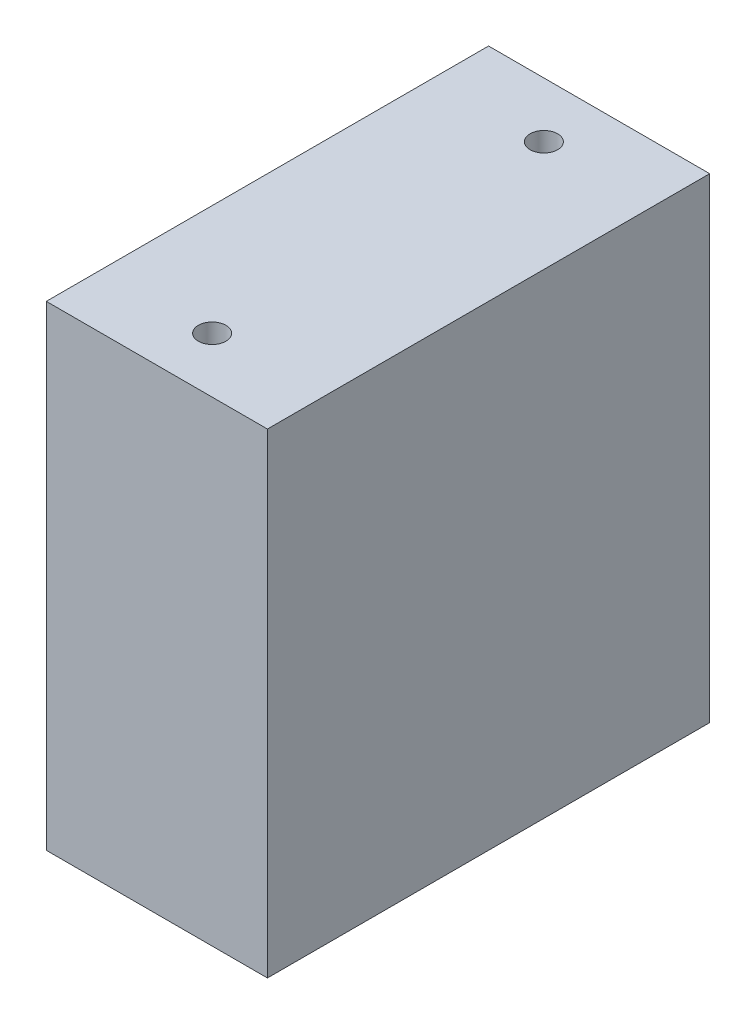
ISO-10303-21;
HEADER;
FILE_DESCRIPTION(('STEP AP214'),'2;1');
FILE_NAME('part.step','',(''),(''),'','','');
FILE_SCHEMA(('AUTOMOTIVE_DESIGN { 1 0 10303 214 1 1 1 1 }'));
ENDSEC;
DATA;
#1=APPLICATION_CONTEXT('core data for automotive mechanical design processes');
#2=APPLICATION_PROTOCOL_DEFINITION('international standard','automotive_design',2000,#1);
#3=PRODUCT_CONTEXT('',#1,'mechanical');
#4=PRODUCT('Part','Part','',(#3));
#5=PRODUCT_RELATED_PRODUCT_CATEGORY('part','',(#4));
#6=PRODUCT_DEFINITION_FORMATION('','',#4);
#7=PRODUCT_DEFINITION_CONTEXT('part definition',#1,'design');
#8=PRODUCT_DEFINITION('design','',#6,#7);
#9=PRODUCT_DEFINITION_SHAPE('','',#8);
#10=(LENGTH_UNIT() NAMED_UNIT(*) SI_UNIT(.MILLI.,.METRE.));
#11=(NAMED_UNIT(*) PLANE_ANGLE_UNIT() SI_UNIT($,.RADIAN.));
#12=(NAMED_UNIT(*) SI_UNIT($,.STERADIAN.) SOLID_ANGLE_UNIT());
#13=UNCERTAINTY_MEASURE_WITH_UNIT(LENGTH_MEASURE(1.E-05),#10,'distance_accuracy_value','');
#14=(GEOMETRIC_REPRESENTATION_CONTEXT(3) GLOBAL_UNCERTAINTY_ASSIGNED_CONTEXT((#13)) GLOBAL_UNIT_ASSIGNED_CONTEXT((#10,
#11,#12)) REPRESENTATION_CONTEXT('',''));
#15=CARTESIAN_POINT('',(0.,0.,0.));
#16=DIRECTION('',(0.,0.,1.));
#17=DIRECTION('',(1.,0.,0.));
#18=AXIS2_PLACEMENT_3D('',#15,#16,#17);
#19=CARTESIAN_POINT('',(0.,65.9999999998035,30.));
#20=DIRECTION('',(0.,1.,0.));
#21=DIRECTION('',(0.,0.,1.));
#22=AXIS2_PLACEMENT_3D('',#19,#20,#21);
#23=CONICAL_SURFACE('',#22,2.49999999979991,1.02974425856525);
#24=CARTESIAN_POINT('',(0.,64.4978484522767,30.));
#25=VERTEX_POINT('',#24);
#26=VERTEX_LOOP('',#25);
#27=FACE_BOUND('',#26,.T.);
#28=CARTESIAN_POINT('',(0.,66.,30.));
#29=DIRECTION('',(0.,1.,0.));
#30=DIRECTION('',(0.,0.,1.));
#31=AXIS2_PLACEMENT_3D('',#28,#29,#30);
#32=CIRCLE('',#31,2.5);
#33=CARTESIAN_POINT('',(0.,66.,32.5));
#34=VERTEX_POINT('',#33);
#35=EDGE_CURVE('E72',#34,#34,#32,.T.);
#36=ORIENTED_EDGE('',*,*,#35,.T.);
#37=EDGE_LOOP('',(#36));
#38=FACE_BOUND('',#37,.T.);
#39=ADVANCED_FACE('F17',(#27,#38),#23,.F.);
#40=CARTESIAN_POINT('',(0.,65.9999999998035,-30.));
#41=DIRECTION('',(0.,1.,0.));
#42=DIRECTION('',(0.,0.,1.));
#43=AXIS2_PLACEMENT_3D('',#40,#41,#42);
#44=CONICAL_SURFACE('',#43,2.49999999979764,1.02974425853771);
#45=CARTESIAN_POINT('',(0.,64.4978484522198,-30.));
#46=VERTEX_POINT('',#45);
#47=VERTEX_LOOP('',#46);
#48=FACE_BOUND('',#47,.T.);
#49=CARTESIAN_POINT('',(0.,66.,-30.));
#50=DIRECTION('',(0.,1.,0.));
#51=DIRECTION('',(0.,0.,1.));
#52=AXIS2_PLACEMENT_3D('',#49,#50,#51);
#53=CIRCLE('',#52,2.5);
#54=CARTESIAN_POINT('',(0.,66.,-27.5));
#55=VERTEX_POINT('',#54);
#56=EDGE_CURVE('E74',#55,#55,#53,.T.);
#57=ORIENTED_EDGE('',*,*,#56,.T.);
#58=EDGE_LOOP('',(#57));
#59=FACE_BOUND('',#58,.T.);
#60=ADVANCED_FACE('F69',(#48,#59),#44,.F.);
#61=CARTESIAN_POINT('',(0.,20.0000000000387,30.));
#62=DIRECTION('',(0.,-1.,0.));
#63=DIRECTION('',(0.,0.,-1.));
#64=AXIS2_PLACEMENT_3D('',#61,#62,#63);
#65=CONICAL_SURFACE('',#64,2.50000000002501,1.0297442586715);
#66=CARTESIAN_POINT('',(0.,21.5021515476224,30.));
#67=VERTEX_POINT('',#66);
#68=VERTEX_LOOP('',#67);
#69=FACE_BOUND('',#68,.T.);
#70=CARTESIAN_POINT('',(0.,20.,30.));
#71=DIRECTION('',(0.,-1.,0.));
#72=DIRECTION('',(0.,0.,-1.));
#73=AXIS2_PLACEMENT_3D('',#70,#71,#72);
#74=CIRCLE('',#73,2.5);
#75=CARTESIAN_POINT('',(0.,20.,27.5));
#76=VERTEX_POINT('',#75);
#77=EDGE_CURVE('E77',#76,#76,#74,.T.);
#78=ORIENTED_EDGE('',*,*,#77,.T.);
#79=EDGE_LOOP('',(#78));
#80=FACE_BOUND('',#79,.T.);
#81=ADVANCED_FACE('F110',(#69,#80),#65,.F.);
#82=CARTESIAN_POINT('',(0.,20.0000000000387,-30.));
#83=DIRECTION('',(0.,-1.,0.));
#84=DIRECTION('',(0.,0.,-1.));
#85=AXIS2_PLACEMENT_3D('',#82,#83,#84);
#86=CONICAL_SURFACE('',#85,2.49999999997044,1.02974425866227);
#87=CARTESIAN_POINT('',(0.,21.5021515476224,-30.));
#88=VERTEX_POINT('',#87);
#89=VERTEX_LOOP('',#88);
#90=FACE_BOUND('',#89,.T.);
#91=CARTESIAN_POINT('',(0.,20.,-30.));
#92=DIRECTION('',(0.,-1.,0.));
#93=DIRECTION('',(0.,0.,-1.));
#94=AXIS2_PLACEMENT_3D('',#91,#92,#93);
#95=CIRCLE('',#94,2.5);
#96=CARTESIAN_POINT('',(0.,20.,-32.5));
#97=VERTEX_POINT('',#96);
#98=EDGE_CURVE('E99',#97,#97,#95,.T.);
#99=ORIENTED_EDGE('',*,*,#98,.T.);
#100=EDGE_LOOP('',(#99));
#101=FACE_BOUND('',#100,.T.);
#102=ADVANCED_FACE('F157',(#90,#101),#86,.F.);
#103=CARTESIAN_POINT('',(0.,86.,30.));
#104=DIRECTION('',(0.,1.,0.));
#105=DIRECTION('',(0.,0.,1.));
#106=AXIS2_PLACEMENT_3D('',#103,#104,#105);
#107=CYLINDRICAL_SURFACE('',#106,2.5);
#108=CARTESIAN_POINT('',(0.,86.,30.));
#109=DIRECTION('',(0.,1.,0.));
#110=DIRECTION('',(0.,0.,1.));
#111=AXIS2_PLACEMENT_3D('',#108,#109,#110);
#112=CIRCLE('',#111,2.5);
#113=CARTESIAN_POINT('',(0.,86.,32.5));
#114=VERTEX_POINT('',#113);
#115=EDGE_CURVE('E20',#114,#114,#112,.F.);
#116=ORIENTED_EDGE('',*,*,#115,.F.);
#117=EDGE_LOOP('',(#116));
#118=FACE_BOUND('',#117,.T.);
#119=ORIENTED_EDGE('',*,*,#35,.F.);
#120=EDGE_LOOP('',(#119));
#121=FACE_BOUND('',#120,.T.);
#122=ADVANCED_FACE('F153',(#118,#121),#107,.F.);
#123=CARTESIAN_POINT('',(0.,86.,-30.));
#124=DIRECTION('',(0.,1.,0.));
#125=DIRECTION('',(0.,0.,1.));
#126=AXIS2_PLACEMENT_3D('',#123,#124,#125);
#127=CYLINDRICAL_SURFACE('',#126,2.5);
#128=CARTESIAN_POINT('',(0.,86.,-30.));
#129=DIRECTION('',(0.,1.,0.));
#130=DIRECTION('',(0.,0.,1.));
#131=AXIS2_PLACEMENT_3D('',#128,#129,#130);
#132=CIRCLE('',#131,2.5);
#133=CARTESIAN_POINT('',(0.,86.,-27.5));
#134=VERTEX_POINT('',#133);
#135=EDGE_CURVE('E87',#134,#134,#132,.F.);
#136=ORIENTED_EDGE('',*,*,#135,.F.);
#137=EDGE_LOOP('',(#136));
#138=FACE_BOUND('',#137,.T.);
#139=ORIENTED_EDGE('',*,*,#56,.F.);
#140=EDGE_LOOP('',(#139));
#141=FACE_BOUND('',#140,.T.);
#142=ADVANCED_FACE('F116',(#138,#141),#127,.F.);
#143=CARTESIAN_POINT('',(0.,0.,30.));
#144=DIRECTION('',(0.,-1.,0.));
#145=DIRECTION('',(0.,0.,-1.));
#146=AXIS2_PLACEMENT_3D('',#143,#144,#145);
#147=CYLINDRICAL_SURFACE('',#146,2.5);
#148=ORIENTED_EDGE('',*,*,#77,.F.);
#149=EDGE_LOOP('',(#148));
#150=FACE_BOUND('',#149,.T.);
#151=CARTESIAN_POINT('',(0.,0.,30.));
#152=DIRECTION('',(0.,-1.,0.));
#153=DIRECTION('',(0.,0.,-1.));
#154=AXIS2_PLACEMENT_3D('',#151,#152,#153);
#155=CIRCLE('',#154,2.5);
#156=CARTESIAN_POINT('',(0.,0.,27.5));
#157=VERTEX_POINT('',#156);
#158=EDGE_CURVE('E84',#157,#157,#155,.T.);
#159=ORIENTED_EDGE('',*,*,#158,.T.);
#160=EDGE_LOOP('',(#159));
#161=FACE_BOUND('',#160,.T.);
#162=ADVANCED_FACE('F112',(#150,#161),#147,.F.);
#163=CARTESIAN_POINT('',(0.,0.,-30.));
#164=DIRECTION('',(0.,-1.,0.));
#165=DIRECTION('',(0.,0.,-1.));
#166=AXIS2_PLACEMENT_3D('',#163,#164,#165);
#167=CYLINDRICAL_SURFACE('',#166,2.5);
#168=ORIENTED_EDGE('',*,*,#98,.F.);
#169=EDGE_LOOP('',(#168));
#170=FACE_BOUND('',#169,.T.);
#171=CARTESIAN_POINT('',(0.,0.,-30.));
#172=DIRECTION('',(0.,-1.,0.));
#173=DIRECTION('',(0.,0.,-1.));
#174=AXIS2_PLACEMENT_3D('',#171,#172,#173);
#175=CIRCLE('',#174,2.5);
#176=CARTESIAN_POINT('',(0.,0.,-32.5));
#177=VERTEX_POINT('',#176);
#178=EDGE_CURVE('E81',#177,#177,#175,.T.);
#179=ORIENTED_EDGE('',*,*,#178,.T.);
#180=EDGE_LOOP('',(#179));
#181=FACE_BOUND('',#180,.T.);
#182=ADVANCED_FACE('F115',(#170,#181),#167,.F.);
#183=CARTESIAN_POINT('',(-20.,86.,-40.));
#184=DIRECTION('',(1.,0.,0.));
#185=DIRECTION('',(0.,0.,-1.));
#186=AXIS2_PLACEMENT_3D('',#183,#184,#185);
#187=PLANE('',#186);
#188=DIRECTION('',(0.,1.,0.));
#189=VECTOR('',#188,1.);
#190=CARTESIAN_POINT('',(-20.,86.,40.));
#191=LINE('',#190,#189);
#192=CARTESIAN_POINT('',(-20.,0.,40.));
#193=VERTEX_POINT('',#192);
#194=CARTESIAN_POINT('',(-20.,86.,40.));
#195=VERTEX_POINT('',#194);
#196=EDGE_CURVE('E95',#193,#195,#191,.T.);
#197=ORIENTED_EDGE('',*,*,#196,.T.);
#198=DIRECTION('',(0.,0.,1.));
#199=VECTOR('',#198,1.);
#200=CARTESIAN_POINT('',(-20.,86.,0.));
#201=LINE('',#200,#199);
#202=CARTESIAN_POINT('',(-20.,86.,-40.));
#203=VERTEX_POINT('',#202);
#204=EDGE_CURVE('E89',#203,#195,#201,.T.);
#205=ORIENTED_EDGE('',*,*,#204,.F.);
#206=DIRECTION('',(0.,1.,0.));
#207=VECTOR('',#206,1.);
#208=CARTESIAN_POINT('',(-20.,86.,-40.));
#209=LINE('',#208,#207);
#210=CARTESIAN_POINT('',(-20.,0.,-40.));
#211=VERTEX_POINT('',#210);
#212=EDGE_CURVE('E86',#203,#211,#209,.F.);
#213=ORIENTED_EDGE('',*,*,#212,.T.);
#214=DIRECTION('',(0.,0.,1.));
#215=VECTOR('',#214,1.);
#216=CARTESIAN_POINT('',(-20.,0.,0.));
#217=LINE('',#216,#215);
#218=EDGE_CURVE('E305',#211,#193,#217,.T.);
#219=ORIENTED_EDGE('',*,*,#218,.T.);
#220=EDGE_LOOP('',(#197,#205,#213,#219));
#221=FACE_BOUND('',#220,.T.);
#222=ADVANCED_FACE('F144',(#221),#187,.F.);
#223=CARTESIAN_POINT('',(-20.,86.,40.));
#224=DIRECTION('',(0.,0.,-1.));
#225=DIRECTION('',(-1.,0.,0.));
#226=AXIS2_PLACEMENT_3D('',#223,#224,#225);
#227=PLANE('',#226);
#228=DIRECTION('',(0.,1.,0.));
#229=VECTOR('',#228,1.);
#230=CARTESIAN_POINT('',(20.,86.,40.));
#231=LINE('',#230,#229);
#232=CARTESIAN_POINT('',(20.,0.,40.));
#233=VERTEX_POINT('',#232);
#234=CARTESIAN_POINT('',(20.,86.,40.));
#235=VERTEX_POINT('',#234);
#236=EDGE_CURVE('E298',#233,#235,#231,.T.);
#237=ORIENTED_EDGE('',*,*,#236,.T.);
#238=DIRECTION('',(1.,0.,0.));
#239=VECTOR('',#238,1.);
#240=CARTESIAN_POINT('',(0.,86.,40.));
#241=LINE('',#240,#239);
#242=EDGE_CURVE('E92',#195,#235,#241,.T.);
#243=ORIENTED_EDGE('',*,*,#242,.F.);
#244=ORIENTED_EDGE('',*,*,#196,.F.);
#245=DIRECTION('',(1.,0.,0.));
#246=VECTOR('',#245,1.);
#247=CARTESIAN_POINT('',(0.,0.,40.));
#248=LINE('',#247,#246);
#249=EDGE_CURVE('E299',#193,#233,#248,.T.);
#250=ORIENTED_EDGE('',*,*,#249,.T.);
#251=EDGE_LOOP('',(#237,#243,#244,#250));
#252=FACE_BOUND('',#251,.T.);
#253=ADVANCED_FACE('F140',(#252),#227,.F.);
#254=CARTESIAN_POINT('',(0.,86.,0.));
#255=DIRECTION('',(0.,1.,0.));
#256=DIRECTION('',(0.,0.,1.));
#257=AXIS2_PLACEMENT_3D('',#254,#255,#256);
#258=PLANE('',#257);
#259=ORIENTED_EDGE('',*,*,#204,.T.);
#260=ORIENTED_EDGE('',*,*,#242,.T.);
#261=DIRECTION('',(0.,0.,1.));
#262=VECTOR('',#261,1.);
#263=CARTESIAN_POINT('',(20.,86.,-40.));
#264=LINE('',#263,#262);
#265=CARTESIAN_POINT('',(20.,86.,-40.));
#266=VERTEX_POINT('',#265);
#267=EDGE_CURVE('E301',#235,#266,#264,.F.);
#268=ORIENTED_EDGE('',*,*,#267,.T.);
#269=DIRECTION('',(1.,0.,0.));
#270=VECTOR('',#269,1.);
#271=CARTESIAN_POINT('',(-20.,86.,-40.));
#272=LINE('',#271,#270);
#273=EDGE_CURVE('E312',#266,#203,#272,.F.);
#274=ORIENTED_EDGE('',*,*,#273,.T.);
#275=EDGE_LOOP('',(#259,#260,#268,#274));
#276=FACE_BOUND('',#275,.T.);
#277=ORIENTED_EDGE('',*,*,#135,.T.);
#278=EDGE_LOOP('',(#277));
#279=FACE_BOUND('',#278,.T.);
#280=ORIENTED_EDGE('',*,*,#115,.T.);
#281=EDGE_LOOP('',(#280));
#282=FACE_BOUND('',#281,.T.);
#283=ADVANCED_FACE('F132',(#276,#279,#282),#258,.T.);
#284=CARTESIAN_POINT('',(-20.,86.,-40.));
#285=DIRECTION('',(0.,0.,1.));
#286=DIRECTION('',(1.,0.,0.));
#287=AXIS2_PLACEMENT_3D('',#284,#285,#286);
#288=PLANE('',#287);
#289=ORIENTED_EDGE('',*,*,#212,.F.);
#290=ORIENTED_EDGE('',*,*,#273,.F.);
#291=DIRECTION('',(0.,1.,0.));
#292=VECTOR('',#291,1.);
#293=CARTESIAN_POINT('',(20.,86.,-40.));
#294=LINE('',#293,#292);
#295=CARTESIAN_POINT('',(20.,0.,-40.));
#296=VERTEX_POINT('',#295);
#297=EDGE_CURVE('E26',#266,#296,#294,.F.);
#298=ORIENTED_EDGE('',*,*,#297,.T.);
#299=DIRECTION('',(1.,0.,0.));
#300=VECTOR('',#299,1.);
#301=CARTESIAN_POINT('',(0.,0.,-40.));
#302=LINE('',#301,#300);
#303=EDGE_CURVE('E34',#296,#211,#302,.F.);
#304=ORIENTED_EDGE('',*,*,#303,.T.);
#305=EDGE_LOOP('',(#289,#290,#298,#304));
#306=FACE_BOUND('',#305,.T.);
#307=ADVANCED_FACE('F123',(#306),#288,.F.);
#308=CARTESIAN_POINT('',(0.,0.,0.));
#309=DIRECTION('',(0.,1.,0.));
#310=DIRECTION('',(0.,0.,1.));
#311=AXIS2_PLACEMENT_3D('',#308,#309,#310);
#312=PLANE('',#311);
#313=ORIENTED_EDGE('',*,*,#249,.F.);
#314=ORIENTED_EDGE('',*,*,#218,.F.);
#315=ORIENTED_EDGE('',*,*,#303,.F.);
#316=DIRECTION('',(0.,0.,1.));
#317=VECTOR('',#316,1.);
#318=CARTESIAN_POINT('',(20.,0.,-40.));
#319=LINE('',#318,#317);
#320=EDGE_CURVE('E11',#296,#233,#319,.T.);
#321=ORIENTED_EDGE('',*,*,#320,.T.);
#322=EDGE_LOOP('',(#313,#314,#315,#321));
#323=FACE_BOUND('',#322,.T.);
#324=ORIENTED_EDGE('',*,*,#178,.F.);
#325=EDGE_LOOP('',(#324));
#326=FACE_BOUND('',#325,.T.);
#327=ORIENTED_EDGE('',*,*,#158,.F.);
#328=EDGE_LOOP('',(#327));
#329=FACE_BOUND('',#328,.T.);
#330=ADVANCED_FACE('F120',(#323,#326,#329),#312,.F.);
#331=CARTESIAN_POINT('',(20.,86.,-40.));
#332=DIRECTION('',(-1.,0.,0.));
#333=DIRECTION('',(0.,0.,1.));
#334=AXIS2_PLACEMENT_3D('',#331,#332,#333);
#335=PLANE('',#334);
#336=ORIENTED_EDGE('',*,*,#297,.F.);
#337=ORIENTED_EDGE('',*,*,#267,.F.);
#338=ORIENTED_EDGE('',*,*,#236,.F.);
#339=ORIENTED_EDGE('',*,*,#320,.F.);
#340=EDGE_LOOP('',(#336,#337,#338,#339));
#341=FACE_BOUND('',#340,.T.);
#342=ADVANCED_FACE('F122',(#341),#335,.F.);
#343=CLOSED_SHELL('',(#39,#60,#81,#102,#122,#142,#162,#182,#222,#253,#283,#307,#330,#342));
#344=MANIFOLD_SOLID_BREP('B1',#343);
#345=ADVANCED_BREP_SHAPE_REPRESENTATION('',(#18,#344),#14);
#346=SHAPE_DEFINITION_REPRESENTATION(#9,#345);
ENDSEC;
END-ISO-10303-21;
